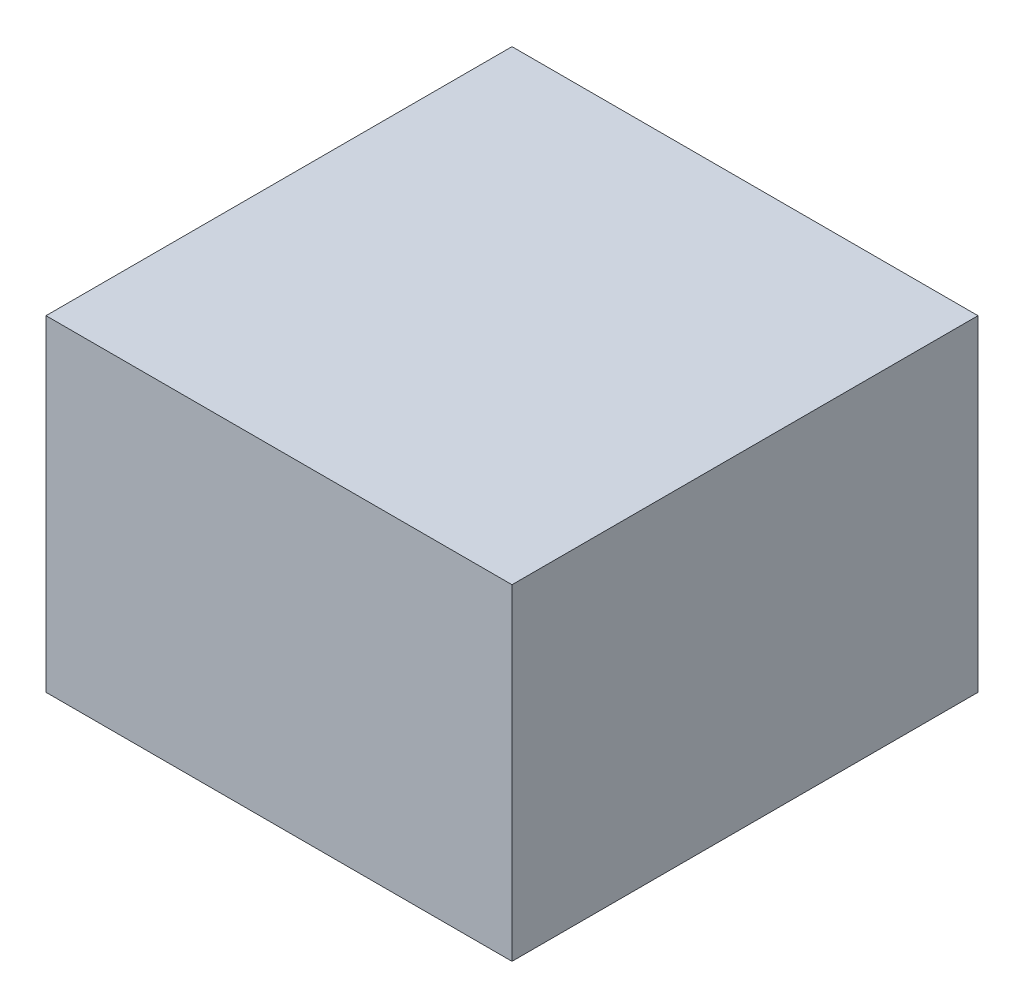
from build123d import *

# Parameters (mm, degrees)
SKETCH1_W           = 45
SKETCH1_H           = 45
BOSS_EXTRUDE1_DEPTH = 31.5


with BuildPart() as part:
    # Sketch1 → Boss-Extrude1 (new body)
    with BuildSketch(Plane(origin=(0, 0, 0), x_dir=(1, 0, 0), z_dir=(0, 1, 0))):
        Rectangle(SKETCH1_W, SKETCH1_H)
    extrude(amount=BOSS_EXTRUDE1_DEPTH)


solid = part.part
